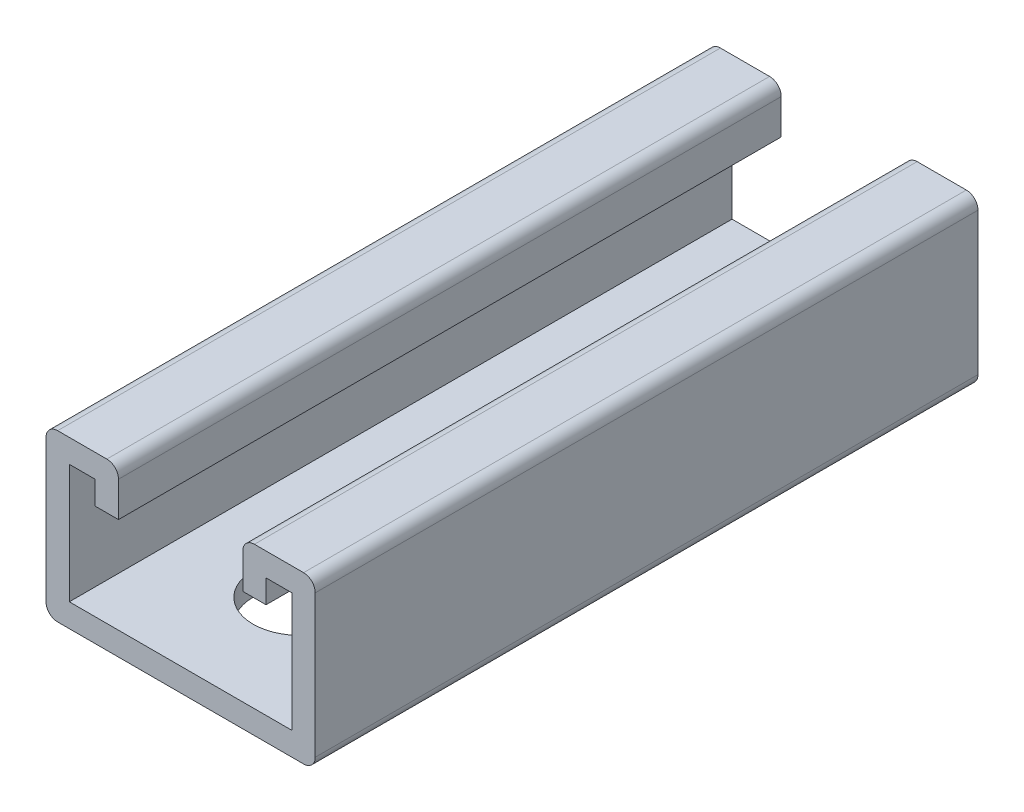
from build123d import *

# Parameters (mm, degrees)
BASE_EXTRUDE_DEPTH = 101.6
SLOT_DEPTH         = 107.74093126
LPATTERN1_COUNT    = 2
LPATTERN1_PITCH    = 50.8


with BuildPart() as part:
    # Sketch1 → Base-Extrude (new body)
    with BuildSketch(Plane.XY):
        with BuildLine():
            Line((-11.3109375, 12.7), (-18.8515625, 12.7))
            ThreePointArc((-18.8515625, 12.7), (-20.114411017, 12.176911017), (-20.6375, 10.9140625))
            Line((-20.6375, 10.9140625), (-20.6375, -10.9140625))
            ThreePointArc((-20.6375, -10.9140625), (-20.114411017, -12.176911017), (-18.8515625, -12.7))
            Line((-18.8515625, -12.7), (18.8515625, -12.7))
            ThreePointArc((18.8515625, -12.7), (20.114411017, -12.176911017), (20.6375, -10.9140625))
            Line((20.6375, -10.9140625), (20.6375, 10.9140625))
            ThreePointArc((20.6375, 10.9140625), (20.114411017, 12.176911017), (18.8515625, 12.7))
            Line((18.8515625, 12.7), (11.3109375, 12.7))
            ThreePointArc((11.3109375, 12.7), (10.048088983, 12.176911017), (9.525, 10.9140625))
            Line((9.525, 10.9140625), (9.525, 5.55625))
            Line((9.525, 5.55625), (13.096875, 5.55625))
            Line((13.096875, 5.55625), (13.096875, 9.128125))
            Line((13.096875, 9.128125), (17.065625, 9.128125))
            Line((17.065625, 9.128125), (17.065625, -9.128125))
            Line((17.065625, -9.128125), (-17.065625, -9.128125))
            Line((-17.065625, -9.128125), (-17.065625, 9.128125))
            Line((-17.065625, 9.128125), (-13.096875, 9.128125))
            Line((-13.096875, 9.128125), (-13.096875, 5.55625))
            Line((-13.096875, 5.55625), (-9.525, 5.55625))
            Line((-9.525, 5.55625), (-9.525, 10.9140625))
            ThreePointArc((-9.525, 10.9140625), (-10.048088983, 12.176911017), (-11.3109375, 12.7))
        make_face()
    extrude(amount=BASE_EXTRUDE_DEPTH)

    # Sketch2 → Slot (cut, through all)
    with BuildSketch(Plane.XZ.offset(12.7)):
        with BuildLine():
            Line((7.14375, 32.54375), (7.14375, 18.25625))
            ThreePointArc((7.14375, 18.25625), (0, 11.1125), (-7.14375, 18.25625))
            Line((-7.14375, 18.25625), (-7.14375, 32.54375))
            ThreePointArc((-7.14375, 32.54375), (0, 39.6875), (7.14375, 32.54375))
        make_face()
    slot = extrude(amount=-SLOT_DEPTH, mode=Mode.SUBTRACT)

    # LPattern1: Slot ×2
    with Locations(*[(0, 0, i * LPATTERN1_PITCH) for i in range(1, LPATTERN1_COUNT)]):
        add(slot, mode=Mode.SUBTRACT)


solid = part.part
